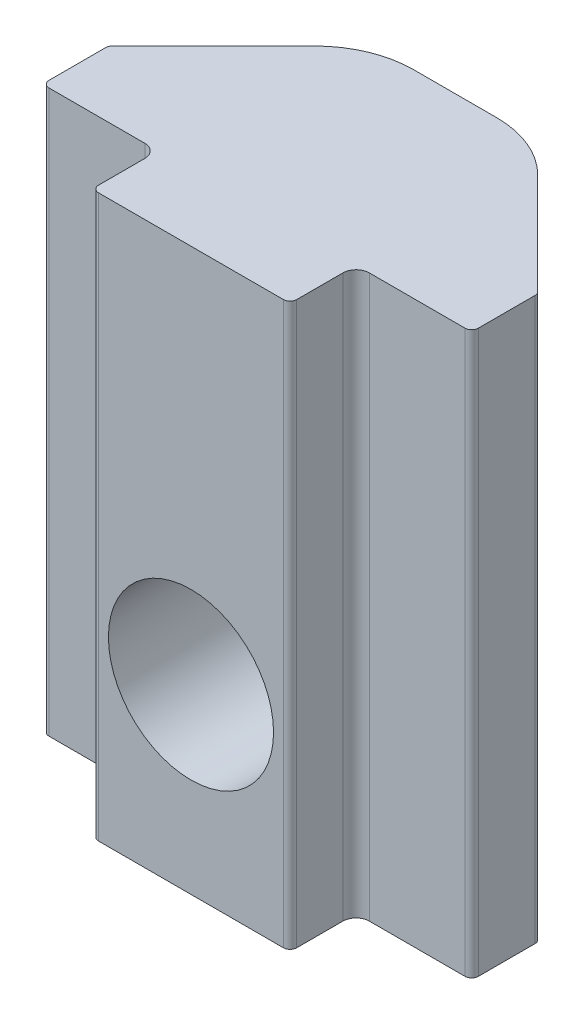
ISO-10303-21;
HEADER;
FILE_DESCRIPTION(('STEP AP214'),'2;1');
FILE_NAME('part.step','',(''),(''),'','','');
FILE_SCHEMA(('AUTOMOTIVE_DESIGN { 1 0 10303 214 1 1 1 1 }'));
ENDSEC;
DATA;
#1=APPLICATION_CONTEXT('core data for automotive mechanical design processes');
#2=APPLICATION_PROTOCOL_DEFINITION('international standard','automotive_design',2000,#1);
#3=PRODUCT_CONTEXT('',#1,'mechanical');
#4=PRODUCT('Part','Part','',(#3));
#5=PRODUCT_RELATED_PRODUCT_CATEGORY('part','',(#4));
#6=PRODUCT_DEFINITION_FORMATION('','',#4);
#7=PRODUCT_DEFINITION_CONTEXT('part definition',#1,'design');
#8=PRODUCT_DEFINITION('design','',#6,#7);
#9=PRODUCT_DEFINITION_SHAPE('','',#8);
#10=(LENGTH_UNIT() NAMED_UNIT(*) SI_UNIT(.MILLI.,.METRE.));
#11=(NAMED_UNIT(*) PLANE_ANGLE_UNIT() SI_UNIT($,.RADIAN.));
#12=(NAMED_UNIT(*) SI_UNIT($,.STERADIAN.) SOLID_ANGLE_UNIT());
#13=UNCERTAINTY_MEASURE_WITH_UNIT(LENGTH_MEASURE(1.E-05),#10,'distance_accuracy_value','');
#14=(GEOMETRIC_REPRESENTATION_CONTEXT(3) GLOBAL_UNCERTAINTY_ASSIGNED_CONTEXT((#13)) GLOBAL_UNIT_ASSIGNED_CONTEXT((#10,
#11,#12)) REPRESENTATION_CONTEXT('',''));
#15=CARTESIAN_POINT('',(0.,0.,0.));
#16=DIRECTION('',(0.,0.,1.));
#17=DIRECTION('',(1.,0.,0.));
#18=AXIS2_PLACEMENT_3D('',#15,#16,#17);
#19=CARTESIAN_POINT('',(-5.00000019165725E-09,1000.,-6.00000001));
#20=DIRECTION('',(0.,0.,-1.));
#21=DIRECTION('',(0.,-1.,0.));
#22=AXIS2_PLACEMENT_3D('',#19,#20,#21);
#23=PLANE('',#22);
#24=CARTESIAN_POINT('',(0.,-994.5,-6.00000001));
#25=DIRECTION('',(0.,0.,1.));
#26=DIRECTION('',(1.,0.,0.));
#27=AXIS2_PLACEMENT_3D('',#24,#25,#26);
#28=CIRCLE('',#27,2.5);
#29=CARTESIAN_POINT('',(1.25735931,-992.339202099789,-6.00000001));
#30=VERTEX_POINT('',#29);
#31=CARTESIAN_POINT('',(-1.25735932,-992.339202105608,-6.00000001));
#32=VERTEX_POINT('',#31);
#33=EDGE_CURVE('E59',#30,#32,#28,.T.);
#34=ORIENTED_EDGE('',*,*,#33,.T.);
#35=DIRECTION('',(0.,-1.,0.));
#36=VECTOR('',#35,1.);
#37=CARTESIAN_POINT('',(-1.25735932,1000.,-6.00000001));
#38=LINE('',#37,#36);
#39=CARTESIAN_POINT('',(-1.25735932,-983.,-6.00000001));
#40=VERTEX_POINT('',#39);
#41=EDGE_CURVE('E205',#40,#32,#38,.T.);
#42=ORIENTED_EDGE('',*,*,#41,.F.);
#43=DIRECTION('',(1.,0.,0.));
#44=VECTOR('',#43,1.);
#45=CARTESIAN_POINT('',(-6.49999999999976,-983.,-6.00000001));
#46=LINE('',#45,#44);
#47=CARTESIAN_POINT('',(1.25735931,-983.,-6.00000001));
#48=VERTEX_POINT('',#47);
#49=EDGE_CURVE('E385',#40,#48,#46,.T.);
#50=ORIENTED_EDGE('',*,*,#49,.T.);
#51=DIRECTION('',(0.,-1.,0.));
#52=VECTOR('',#51,1.);
#53=CARTESIAN_POINT('',(1.25735931,1000.,-6.00000001));
#54=LINE('',#53,#52);
#55=EDGE_CURVE('E207',#48,#30,#54,.T.);
#56=ORIENTED_EDGE('',*,*,#55,.T.);
#57=EDGE_LOOP('',(#34,#42,#50,#56));
#58=FACE_BOUND('',#57,.T.);
#59=ADVANCED_FACE('F44',(#58),#23,.T.);
#60=CARTESIAN_POINT('',(-5.10307701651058E-09,-1000.,-1.69499752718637));
#61=DIRECTION('',(0.,-1.,0.));
#62=DIRECTION('',(0.,0.,-1.));
#63=AXIS2_PLACEMENT_3D('',#60,#61,#62);
#64=PLANE('',#63);
#65=DIRECTION('',(0.,0.,1.));
#66=VECTOR('',#65,1.);
#67=CARTESIAN_POINT('',(-3.00000001,-1000.,0.4));
#68=LINE('',#67,#66);
#69=CARTESIAN_POINT('',(-3.,-1000.,0.4));
#70=VERTEX_POINT('',#69);
#71=CARTESIAN_POINT('',(-3.00000001,-1000.,1.8));
#72=VERTEX_POINT('',#71);
#73=EDGE_CURVE('E241',#70,#72,#68,.T.);
#74=ORIENTED_EDGE('',*,*,#73,.F.);
#75=CARTESIAN_POINT('',(-3.4,-1000.,0.4));
#76=DIRECTION('',(0.,-1.,0.));
#77=DIRECTION('',(0.,0.,-1.));
#78=AXIS2_PLACEMENT_3D('',#75,#76,#77);
#79=CIRCLE('',#78,0.4);
#80=CARTESIAN_POINT('',(-3.4,-1000.,0.));
#81=VERTEX_POINT('',#80);
#82=EDGE_CURVE('E52',#81,#70,#79,.T.);
#83=ORIENTED_EDGE('',*,*,#82,.F.);
#84=DIRECTION('',(1.,0.,0.));
#85=VECTOR('',#84,1.);
#86=CARTESIAN_POINT('',(-6.3,-1000.,0.));
#87=LINE('',#86,#85);
#88=CARTESIAN_POINT('',(-6.3,-1000.,0.));
#89=VERTEX_POINT('',#88);
#90=EDGE_CURVE('E255',#89,#81,#87,.T.);
#91=ORIENTED_EDGE('',*,*,#90,.F.);
#92=CARTESIAN_POINT('',(-6.3,-1000.,-0.2));
#93=DIRECTION('',(0.,1.,0.));
#94=DIRECTION('',(0.,0.,1.));
#95=AXIS2_PLACEMENT_3D('',#92,#93,#94);
#96=CIRCLE('',#95,0.2);
#97=CARTESIAN_POINT('',(-6.5,-1000.,-0.2));
#98=VERTEX_POINT('',#97);
#99=EDGE_CURVE('E274',#98,#89,#96,.T.);
#100=ORIENTED_EDGE('',*,*,#99,.F.);
#101=DIRECTION('',(0.,0.,1.));
#102=VECTOR('',#101,1.);
#103=CARTESIAN_POINT('',(-6.5,-1000.,-1.91715729));
#104=LINE('',#103,#102);
#105=CARTESIAN_POINT('',(-6.5,-1000.,-1.91715729));
#106=VERTEX_POINT('',#105);
#107=EDGE_CURVE('E277',#106,#98,#104,.T.);
#108=ORIENTED_EDGE('',*,*,#107,.F.);
#109=CARTESIAN_POINT('',(-6.3,-1000.,-1.91715728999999));
#110=DIRECTION('',(0.,1.,0.));
#111=DIRECTION('',(-1.,0.,0.));
#112=AXIS2_PLACEMENT_3D('',#109,#110,#111);
#113=CIRCLE('',#112,0.200000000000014);
#114=CARTESIAN_POINT('',(-6.44142136,-1000.,-2.05857865));
#115=VERTEX_POINT('',#114);
#116=EDGE_CURVE('E256',#115,#106,#113,.T.);
#117=ORIENTED_EDGE('',*,*,#116,.F.);
#118=DIRECTION('',(-0.707106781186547,0.,0.707106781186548));
#119=VECTOR('',#118,1.);
#120=CARTESIAN_POINT('',(-3.37867966,-1000.,-5.12132035));
#121=LINE('',#120,#119);
#122=CARTESIAN_POINT('',(-3.37867966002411,-1000.,-5.12132035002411));
#123=VERTEX_POINT('',#122);
#124=EDGE_CURVE('E290',#123,#115,#121,.T.);
#125=ORIENTED_EDGE('',*,*,#124,.F.);
#126=CARTESIAN_POINT('',(-1.25735932,-1000.,-3.00000000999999));
#127=DIRECTION('',(0.,1.,0.));
#128=DIRECTION('',(-0.707106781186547,0.,-0.707106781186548));
#129=AXIS2_PLACEMENT_3D('',#126,#127,#128);
#130=CIRCLE('',#129,2.99999999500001);
#131=CARTESIAN_POINT('',(-1.25735932,-1000.,-6.00000001));
#132=VERTEX_POINT('',#131);
#133=EDGE_CURVE('E213',#132,#123,#130,.T.);
#134=ORIENTED_EDGE('',*,*,#133,.F.);
#135=DIRECTION('',(-1.,0.,0.));
#136=VECTOR('',#135,1.);
#137=CARTESIAN_POINT('',(1.25735931,-1000.,-6.00000001));
#138=LINE('',#137,#136);
#139=CARTESIAN_POINT('',(1.25735931,-1000.,-6.00000001));
#140=VERTEX_POINT('',#139);
#141=EDGE_CURVE('E219',#140,#132,#138,.T.);
#142=ORIENTED_EDGE('',*,*,#141,.F.);
#143=CARTESIAN_POINT('',(1.25735931,-1000.,-3.00000001));
#144=DIRECTION('',(0.,1.,0.));
#145=DIRECTION('',(0.,0.,-1.));
#146=AXIS2_PLACEMENT_3D('',#143,#144,#145);
#147=CIRCLE('',#146,3.);
#148=CARTESIAN_POINT('',(3.37867965,-1000.,-5.12132035));
#149=VERTEX_POINT('',#148);
#150=EDGE_CURVE('E261',#149,#140,#147,.T.);
#151=ORIENTED_EDGE('',*,*,#150,.F.);
#152=DIRECTION('',(-0.707106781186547,0.,-0.707106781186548));
#153=VECTOR('',#152,1.);
#154=CARTESIAN_POINT('',(6.44142135,-1000.,-2.05857865));
#155=LINE('',#154,#153);
#156=CARTESIAN_POINT('',(6.44142134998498,-1000.,-2.05857864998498));
#157=VERTEX_POINT('',#156);
#158=EDGE_CURVE('E233',#157,#149,#155,.T.);
#159=ORIENTED_EDGE('',*,*,#158,.F.);
#160=CARTESIAN_POINT('',(6.29999999,-1000.,-1.91715729));
#161=DIRECTION('',(0.,1.,0.));
#162=DIRECTION('',(0.707106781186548,0.,-0.707106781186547));
#163=AXIS2_PLACEMENT_3D('',#160,#161,#162);
#164=CIRCLE('',#163,0.2000000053);
#165=CARTESIAN_POINT('',(6.49999999,-1000.,-1.91715729));
#166=VERTEX_POINT('',#165);
#167=EDGE_CURVE('E234',#166,#157,#164,.T.);
#168=ORIENTED_EDGE('',*,*,#167,.F.);
#169=DIRECTION('',(0.,0.,-1.));
#170=VECTOR('',#169,1.);
#171=CARTESIAN_POINT('',(6.49999999,-1000.,-0.2));
#172=LINE('',#171,#170);
#173=CARTESIAN_POINT('',(6.49999999,-1000.,-0.2));
#174=VERTEX_POINT('',#173);
#175=EDGE_CURVE('E287',#174,#166,#172,.T.);
#176=ORIENTED_EDGE('',*,*,#175,.F.);
#177=CARTESIAN_POINT('',(6.29999999,-1000.,-0.2));
#178=DIRECTION('',(0.,1.,0.));
#179=DIRECTION('',(1.,0.,0.));
#180=AXIS2_PLACEMENT_3D('',#177,#178,#179);
#181=CIRCLE('',#180,0.2);
#182=CARTESIAN_POINT('',(6.29999999,-1000.,0.));
#183=VERTEX_POINT('',#182);
#184=EDGE_CURVE('E235',#183,#174,#181,.T.);
#185=ORIENTED_EDGE('',*,*,#184,.F.);
#186=DIRECTION('',(1.,0.,0.));
#187=VECTOR('',#186,1.);
#188=CARTESIAN_POINT('',(3.39999999,-1000.,0.));
#189=LINE('',#188,#187);
#190=CARTESIAN_POINT('',(3.39999999,-1000.,0.));
#191=VERTEX_POINT('',#190);
#192=EDGE_CURVE('E244',#191,#183,#189,.T.);
#193=ORIENTED_EDGE('',*,*,#192,.F.);
#194=CARTESIAN_POINT('',(3.39999999,-1000.,0.4));
#195=DIRECTION('',(0.,-1.,0.));
#196=DIRECTION('',(-1.,0.,0.));
#197=AXIS2_PLACEMENT_3D('',#194,#195,#196);
#198=CIRCLE('',#197,0.4);
#199=CARTESIAN_POINT('',(2.99999999,-1000.,0.4));
#200=VERTEX_POINT('',#199);
#201=EDGE_CURVE('E245',#200,#191,#198,.T.);
#202=ORIENTED_EDGE('',*,*,#201,.F.);
#203=DIRECTION('',(0.,0.,-1.));
#204=VECTOR('',#203,1.);
#205=CARTESIAN_POINT('',(2.99999999,-1000.,1.8));
#206=LINE('',#205,#204);
#207=CARTESIAN_POINT('',(2.99999999,-1000.,1.8));
#208=VERTEX_POINT('',#207);
#209=EDGE_CURVE('E222',#208,#200,#206,.T.);
#210=ORIENTED_EDGE('',*,*,#209,.F.);
#211=CARTESIAN_POINT('',(2.79999999,-1000.,1.8));
#212=DIRECTION('',(0.,1.,0.));
#213=DIRECTION('',(1.,0.,0.));
#214=AXIS2_PLACEMENT_3D('',#211,#212,#213);
#215=CIRCLE('',#214,0.2);
#216=CARTESIAN_POINT('',(2.79999999,-1000.,2.));
#217=VERTEX_POINT('',#216);
#218=EDGE_CURVE('E250',#217,#208,#215,.T.);
#219=ORIENTED_EDGE('',*,*,#218,.F.);
#220=DIRECTION('',(1.,0.,0.));
#221=VECTOR('',#220,1.);
#222=CARTESIAN_POINT('',(-2.80000001,-1000.,2.));
#223=LINE('',#222,#221);
#224=CARTESIAN_POINT('',(-2.80000001,-1000.,2.));
#225=VERTEX_POINT('',#224);
#226=EDGE_CURVE('E230',#225,#217,#223,.T.);
#227=ORIENTED_EDGE('',*,*,#226,.F.);
#228=CARTESIAN_POINT('',(-2.80000001,-1000.,1.8));
#229=DIRECTION('',(0.,1.,0.));
#230=DIRECTION('',(0.,0.,1.));
#231=AXIS2_PLACEMENT_3D('',#228,#229,#230);
#232=CIRCLE('',#231,0.2);
#233=EDGE_CURVE('E226',#72,#225,#232,.T.);
#234=ORIENTED_EDGE('',*,*,#233,.F.);
#235=EDGE_LOOP('',(#74,#83,#91,#100,#108,#117,#125,#134,#142,#151,#159,#168,#176,#185,#193,#202,
#210,#219,#227,#234));
#236=FACE_BOUND('',#235,.T.);
#237=ADVANCED_FACE('F310',(#236),#64,.T.);
#238=CARTESIAN_POINT('',(-3.4,1000.,0.4));
#239=DIRECTION('',(0.,-1.,0.));
#240=DIRECTION('',(0.,0.,-1.));
#241=AXIS2_PLACEMENT_3D('',#238,#239,#240);
#242=CYLINDRICAL_SURFACE('',#241,0.4);
#243=DIRECTION('',(0.,-1.,0.));
#244=VECTOR('',#243,1.);
#245=CARTESIAN_POINT('',(-3.,1000.,0.4));
#246=LINE('',#245,#244);
#247=CARTESIAN_POINT('',(-3.,-983.,0.4));
#248=VERTEX_POINT('',#247);
#249=EDGE_CURVE('E224',#248,#70,#246,.T.);
#250=ORIENTED_EDGE('',*,*,#249,.F.);
#251=CARTESIAN_POINT('',(-3.4,-983.,0.4));
#252=DIRECTION('',(0.,-1.,0.));
#253=DIRECTION('',(0.,0.,-1.));
#254=AXIS2_PLACEMENT_3D('',#251,#252,#253);
#255=CIRCLE('',#254,0.4);
#256=CARTESIAN_POINT('',(-3.4,-983.,0.));
#257=VERTEX_POINT('',#256);
#258=EDGE_CURVE('E66',#248,#257,#255,.F.);
#259=ORIENTED_EDGE('',*,*,#258,.T.);
#260=DIRECTION('',(0.,-1.,0.));
#261=VECTOR('',#260,1.);
#262=CARTESIAN_POINT('',(-3.4,1000.,0.));
#263=LINE('',#262,#261);
#264=EDGE_CURVE('E253',#257,#81,#263,.T.);
#265=ORIENTED_EDGE('',*,*,#264,.T.);
#266=ORIENTED_EDGE('',*,*,#82,.T.);
#267=EDGE_LOOP('',(#250,#259,#265,#266));
#268=FACE_BOUND('',#267,.T.);
#269=ADVANCED_FACE('F340',(#268),#242,.F.);
#270=CARTESIAN_POINT('',(-4.85,1000.,0.));
#271=DIRECTION('',(0.,0.,1.));
#272=DIRECTION('',(1.,0.,0.));
#273=AXIS2_PLACEMENT_3D('',#270,#271,#272);
#274=PLANE('',#273);
#275=DIRECTION('',(1.,0.,0.));
#276=VECTOR('',#275,1.);
#277=CARTESIAN_POINT('',(-4.85,-983.,0.));
#278=LINE('',#277,#276);
#279=CARTESIAN_POINT('',(-6.3,-983.,0.));
#280=VERTEX_POINT('',#279);
#281=EDGE_CURVE('E347',#280,#257,#278,.T.);
#282=ORIENTED_EDGE('',*,*,#281,.F.);
#283=DIRECTION('',(0.,-1.,0.));
#284=VECTOR('',#283,1.);
#285=CARTESIAN_POINT('',(-6.3,1000.,0.));
#286=LINE('',#285,#284);
#287=EDGE_CURVE('E272',#280,#89,#286,.T.);
#288=ORIENTED_EDGE('',*,*,#287,.T.);
#289=ORIENTED_EDGE('',*,*,#90,.T.);
#290=ORIENTED_EDGE('',*,*,#264,.F.);
#291=EDGE_LOOP('',(#282,#288,#289,#290));
#292=FACE_BOUND('',#291,.T.);
#293=ADVANCED_FACE('F345',(#292),#274,.T.);
#294=CARTESIAN_POINT('',(-6.3,1000.,-0.2));
#295=DIRECTION('',(0.,-1.,0.));
#296=DIRECTION('',(0.,0.,1.));
#297=AXIS2_PLACEMENT_3D('',#294,#295,#296);
#298=CYLINDRICAL_SURFACE('',#297,0.2);
#299=CARTESIAN_POINT('',(-6.3,-983.,-0.2));
#300=DIRECTION('',(0.,-1.,0.));
#301=DIRECTION('',(0.,0.,-1.));
#302=AXIS2_PLACEMENT_3D('',#299,#300,#301);
#303=CIRCLE('',#302,0.2);
#304=CARTESIAN_POINT('',(-6.49999999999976,-983.,-0.2));
#305=VERTEX_POINT('',#304);
#306=EDGE_CURVE('E351',#305,#280,#303,.F.);
#307=ORIENTED_EDGE('',*,*,#306,.F.);
#308=DIRECTION('',(0.,-1.,0.));
#309=VECTOR('',#308,1.);
#310=CARTESIAN_POINT('',(-6.5,1000.,-0.2));
#311=LINE('',#310,#309);
#312=EDGE_CURVE('E275',#305,#98,#311,.T.);
#313=ORIENTED_EDGE('',*,*,#312,.T.);
#314=ORIENTED_EDGE('',*,*,#99,.T.);
#315=ORIENTED_EDGE('',*,*,#287,.F.);
#316=EDGE_LOOP('',(#307,#313,#314,#315));
#317=FACE_BOUND('',#316,.T.);
#318=ADVANCED_FACE('F350',(#317),#298,.T.);
#319=CARTESIAN_POINT('',(-6.5,1000.,-1.058578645));
#320=DIRECTION('',(-1.,0.,0.));
#321=DIRECTION('',(0.,0.,1.));
#322=AXIS2_PLACEMENT_3D('',#319,#320,#321);
#323=PLANE('',#322);
#324=DIRECTION('',(0.,0.,1.));
#325=VECTOR('',#324,1.);
#326=CARTESIAN_POINT('',(-6.49999999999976,-983.,-6.00000001));
#327=LINE('',#326,#325);
#328=CARTESIAN_POINT('',(-6.49999999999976,-983.,-1.91715728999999));
#329=VERTEX_POINT('',#328);
#330=EDGE_CURVE('E383',#329,#305,#327,.T.);
#331=ORIENTED_EDGE('',*,*,#330,.F.);
#332=DIRECTION('',(0.,-1.,0.));
#333=VECTOR('',#332,1.);
#334=CARTESIAN_POINT('',(-6.5,1000.,-1.91715729));
#335=LINE('',#334,#333);
#336=EDGE_CURVE('E259',#329,#106,#335,.T.);
#337=ORIENTED_EDGE('',*,*,#336,.T.);
#338=ORIENTED_EDGE('',*,*,#107,.T.);
#339=ORIENTED_EDGE('',*,*,#312,.F.);
#340=EDGE_LOOP('',(#331,#337,#338,#339));
#341=FACE_BOUND('',#340,.T.);
#342=ADVANCED_FACE('F355',(#341),#323,.T.);
#343=CARTESIAN_POINT('',(-6.3,1000.,-1.91715728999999));
#344=DIRECTION('',(0.,-1.,0.));
#345=DIRECTION('',(-1.,0.,0.));
#346=AXIS2_PLACEMENT_3D('',#343,#344,#345);
#347=CYLINDRICAL_SURFACE('',#346,0.200000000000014);
#348=CARTESIAN_POINT('',(-6.3,-983.,-1.91715728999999));
#349=DIRECTION('',(0.,-1.,0.));
#350=DIRECTION('',(0.,0.,-1.));
#351=AXIS2_PLACEMENT_3D('',#348,#349,#350);
#352=CIRCLE('',#351,0.200000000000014);
#353=CARTESIAN_POINT('',(-6.44142136,-983.,-2.05857865));
#354=VERTEX_POINT('',#353);
#355=EDGE_CURVE('E303',#354,#329,#352,.F.);
#356=ORIENTED_EDGE('',*,*,#355,.F.);
#357=DIRECTION('',(0.,-1.,0.));
#358=VECTOR('',#357,1.);
#359=CARTESIAN_POINT('',(-6.44142136,1000.,-2.05857865));
#360=LINE('',#359,#358);
#361=EDGE_CURVE('E260',#354,#115,#360,.T.);
#362=ORIENTED_EDGE('',*,*,#361,.T.);
#363=ORIENTED_EDGE('',*,*,#116,.T.);
#364=ORIENTED_EDGE('',*,*,#336,.F.);
#365=EDGE_LOOP('',(#356,#362,#363,#364));
#366=FACE_BOUND('',#365,.T.);
#367=ADVANCED_FACE('F301',(#366),#347,.T.);
#368=CARTESIAN_POINT('',(-4.91005051,1000.,-3.5899495));
#369=DIRECTION('',(-0.707106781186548,0.,-0.707106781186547));
#370=DIRECTION('',(-0.707106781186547,0.,0.707106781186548));
#371=AXIS2_PLACEMENT_3D('',#368,#369,#370);
#372=PLANE('',#371);
#373=DIRECTION('',(-0.707106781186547,0.,0.707106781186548));
#374=VECTOR('',#373,1.);
#375=CARTESIAN_POINT('',(-4.91005051,-983.,-3.5899495));
#376=LINE('',#375,#374);
#377=CARTESIAN_POINT('',(-3.37867966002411,-983.,-5.12132035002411));
#378=VERTEX_POINT('',#377);
#379=EDGE_CURVE('E315',#378,#354,#376,.T.);
#380=ORIENTED_EDGE('',*,*,#379,.F.);
#381=DIRECTION('',(0.,-1.,0.));
#382=VECTOR('',#381,1.);
#383=CARTESIAN_POINT('',(-3.37867966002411,1000.,-5.12132035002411));
#384=LINE('',#383,#382);
#385=EDGE_CURVE('E217',#378,#123,#384,.T.);
#386=ORIENTED_EDGE('',*,*,#385,.T.);
#387=ORIENTED_EDGE('',*,*,#124,.T.);
#388=ORIENTED_EDGE('',*,*,#361,.F.);
#389=EDGE_LOOP('',(#380,#386,#387,#388));
#390=FACE_BOUND('',#389,.T.);
#391=ADVANCED_FACE('F314',(#390),#372,.T.);
#392=CARTESIAN_POINT('',(-1.25735932,1000.,-3.00000000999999));
#393=DIRECTION('',(0.,-1.,0.));
#394=DIRECTION('',(-0.707106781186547,0.,-0.707106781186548));
#395=AXIS2_PLACEMENT_3D('',#392,#393,#394);
#396=CYLINDRICAL_SURFACE('',#395,2.99999999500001);
#397=CARTESIAN_POINT('',(-1.25735932,-996.660797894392,-6.000000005));
#398=CARTESIAN_POINT('',(-1.31608258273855,-996.626639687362,-6.00000708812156));
#399=CARTESIAN_POINT('',(-1.37337508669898,-996.590085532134,-5.99827624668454));
#400=CARTESIAN_POINT('',(-1.4846434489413,-996.512563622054,-5.99189447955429));
#401=CARTESIAN_POINT('',(-1.53862243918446,-996.47160013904,-5.98724635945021));
#402=CARTESIAN_POINT('',(-1.64271093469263,-996.385745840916,-5.97560739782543));
#403=CARTESIAN_POINT('',(-1.69283527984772,-996.340871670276,-5.96862615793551));
#404=CARTESIAN_POINT('',(-1.78916864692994,-996.247393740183,-5.95289047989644));
#405=CARTESIAN_POINT('',(-1.83537674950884,-996.198789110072,-5.94413562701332));
#406=CARTESIAN_POINT('',(-1.96745905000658,-996.048183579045,-5.9161334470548));
#407=CARTESIAN_POINT('',(-2.04721332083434,-995.941041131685,-5.89509251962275));
#408=CARTESIAN_POINT('',(-2.18873334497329,-995.715414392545,-5.8527222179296));
#409=CARTESIAN_POINT('',(-2.25047488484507,-995.596915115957,-5.83139249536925));
#410=CARTESIAN_POINT('',(-2.35791068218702,-995.342892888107,-5.79146926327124));
#411=CARTESIAN_POINT('',(-2.40228997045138,-995.206763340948,-5.77314625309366));
#412=CARTESIAN_POINT('',(-2.46720620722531,-994.928140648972,-5.74546070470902));
#413=CARTESIAN_POINT('',(-2.48777143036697,-994.785655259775,-5.73608754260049));
#414=CARTESIAN_POINT('',(-2.50358919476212,-994.508292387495,-5.72891437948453));
#415=CARTESIAN_POINT('',(-2.50039799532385,-994.373521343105,-5.73040272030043));
#416=CARTESIAN_POINT('',(-2.47250983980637,-994.106682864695,-5.74292405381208));
#417=CARTESIAN_POINT('',(-2.44780914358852,-993.974615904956,-5.75395870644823));
#418=CARTESIAN_POINT('',(-2.37915972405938,-993.7213935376,-5.78260182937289));
#419=CARTESIAN_POINT('',(-2.3359085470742,-993.600018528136,-5.79996893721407));
#420=CARTESIAN_POINT('',(-2.23153165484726,-993.365653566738,-5.83796812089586));
#421=CARTESIAN_POINT('',(-2.17038758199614,-993.252672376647,-5.85860353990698));
#422=CARTESIAN_POINT('',(-2.02520371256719,-993.027557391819,-5.90114563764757));
#423=CARTESIAN_POINT('',(-1.93959382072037,-992.916423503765,-5.92299860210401));
#424=CARTESIAN_POINT('',(-1.75048170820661,-992.709655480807,-5.96075331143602));
#425=CARTESIAN_POINT('',(-1.64702510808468,-992.613983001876,-5.97666991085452));
#426=CARTESIAN_POINT('',(-1.49183677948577,-992.493117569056,-5.99115362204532));
#427=CARTESIAN_POINT('',(-1.44643845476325,-992.460154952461,-5.9943974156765));
#428=CARTESIAN_POINT('',(-1.3534747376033,-992.397323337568,-5.99882076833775));
#429=CARTESIAN_POINT('',(-1.30590997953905,-992.367453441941,-6.00000092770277));
#430=CARTESIAN_POINT('',(-1.25735931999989,-992.339202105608,-6.000000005));
#431=B_SPLINE_CURVE_WITH_KNOTS('',3,(#397,#398,#399,#400,#401,#402,#403,#404,#405,#406,#407,
#408,#409,#410,#411,#412,#413,#414,#415,#416,#417,#418,#419,#420,#421,#422,#423,#424,#425,#426,
#427,#428,#429,#430),.UNSPECIFIED.,.F.,.F.,(4,2,2,2,2,2,2,2,2,2,2,2,2,2,2,2,4),(0.,
0.203679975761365,0.407164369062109,0.609821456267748,0.81252598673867,1.21630157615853,
1.62061746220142,2.0513990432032,2.48166862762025,2.88401205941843,3.28642546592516,
3.67487708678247,4.06372865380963,4.48773243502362,4.91066799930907,5.07912013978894,
5.2475232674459),.UNSPECIFIED.);
#432=CARTESIAN_POINT('',(-1.25735932,-996.660797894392,-6.00000001));
#433=VERTEX_POINT('',#432);
#434=EDGE_CURVE('E190',#433,#32,#431,.T.);
#435=ORIENTED_EDGE('',*,*,#434,.F.);
#436=EDGE_CURVE('E214',#433,#132,#38,.T.);
#437=ORIENTED_EDGE('',*,*,#436,.T.);
#438=ORIENTED_EDGE('',*,*,#133,.T.);
#439=ORIENTED_EDGE('',*,*,#385,.F.);
#440=CARTESIAN_POINT('',(-1.25735932,-983.,-3.00000000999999));
#441=DIRECTION('',(0.,-1.,0.));
#442=DIRECTION('',(0.,0.,-1.));
#443=AXIS2_PLACEMENT_3D('',#440,#441,#442);
#444=CIRCLE('',#443,2.99999999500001);
#445=EDGE_CURVE('E212',#40,#378,#444,.F.);
#446=ORIENTED_EDGE('',*,*,#445,.F.);
#447=ORIENTED_EDGE('',*,*,#41,.T.);
#448=EDGE_LOOP('',(#435,#437,#438,#439,#446,#447));
#449=FACE_BOUND('',#448,.T.);
#450=ADVANCED_FACE('F210',(#449),#396,.T.);
#451=CARTESIAN_POINT('',(1.25735931,-996.660797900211,-6.00000001));
#452=VERTEX_POINT('',#451);
#453=EDGE_CURVE('E194',#433,#452,#28,.T.);
#454=ORIENTED_EDGE('',*,*,#453,.T.);
#455=EDGE_CURVE('E252',#452,#140,#54,.T.);
#456=ORIENTED_EDGE('',*,*,#455,.T.);
#457=ORIENTED_EDGE('',*,*,#141,.T.);
#458=ORIENTED_EDGE('',*,*,#436,.F.);
#459=EDGE_LOOP('',(#454,#456,#457,#458));
#460=FACE_BOUND('',#459,.T.);
#461=ADVANCED_FACE('F430',(#460),#23,.T.);
#462=CARTESIAN_POINT('',(1.25735931,1000.,-3.00000001));
#463=DIRECTION('',(0.,-1.,0.));
#464=DIRECTION('',(0.,0.,-1.));
#465=AXIS2_PLACEMENT_3D('',#462,#463,#464);
#466=CYLINDRICAL_SURFACE('',#465,3.);
#467=CARTESIAN_POINT('',(1.25735931,-992.339202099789,-6.00000001));
#468=CARTESIAN_POINT('',(1.31608257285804,-992.373360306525,-6.0000070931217));
#469=CARTESIAN_POINT('',(1.37337507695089,-992.409914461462,-5.9982762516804));
#470=CARTESIAN_POINT('',(1.48464343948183,-992.48743637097,-5.99189448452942));
#471=CARTESIAN_POINT('',(1.53862242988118,-992.528399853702,-5.98724636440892));
#472=CARTESIAN_POINT('',(1.64271092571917,-992.614254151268,-5.97560740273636));
#473=CARTESIAN_POINT('',(1.69283527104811,-992.659128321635,-5.96862616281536));
#474=CARTESIAN_POINT('',(1.78916863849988,-992.752606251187,-5.9528904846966));
#475=CARTESIAN_POINT('',(1.83537674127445,-992.801210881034,-5.94413563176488));
#476=CARTESIAN_POINT('',(1.96745904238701,-992.951816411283,-5.91613345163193));
#477=CARTESIAN_POINT('',(2.04721331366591,-993.058958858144,-5.89509252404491));
#478=CARTESIAN_POINT('',(2.18873333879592,-993.284585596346,-5.85272222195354));
#479=CARTESIAN_POINT('',(2.25047487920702,-993.403084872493,-5.8313924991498));
#480=CARTESIAN_POINT('',(2.35791067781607,-993.657107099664,-5.79146926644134));
#481=CARTESIAN_POINT('',(2.40228996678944,-993.793236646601,-5.77314625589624));
#482=CARTESIAN_POINT('',(2.46720620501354,-994.071859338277,-5.74546070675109));
#483=CARTESIAN_POINT('',(2.48777142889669,-994.214344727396,-5.73608754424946));
#484=CARTESIAN_POINT('',(2.5035891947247,-994.491707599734,-5.72891438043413));
#485=CARTESIAN_POINT('',(2.50039799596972,-994.626478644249,-5.73040272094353));
#486=CARTESIAN_POINT('',(2.47250984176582,-994.893317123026,-5.74292405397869));
#487=CARTESIAN_POINT('',(2.44780914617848,-995.025384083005,-5.75395870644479));
#488=CARTESIAN_POINT('',(2.37915972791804,-995.278606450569,-5.78260182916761));
#489=CARTESIAN_POINT('',(2.33590855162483,-995.399981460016,-5.79996893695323));
#490=CARTESIAN_POINT('',(2.23153166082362,-995.634346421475,-5.83796812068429));
#491=CARTESIAN_POINT('',(2.17038758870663,-995.747327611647,-5.85860353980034));
#492=CARTESIAN_POINT('',(2.02520372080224,-995.972442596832,-5.90114563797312));
#493=CARTESIAN_POINT('',(1.93959382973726,-996.083576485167,-5.92299860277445));
#494=CARTESIAN_POINT('',(1.75048171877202,-996.290344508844,-5.96075331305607));
#495=CARTESIAN_POINT('',(1.64702511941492,-996.386016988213,-5.97666991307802));
#496=CARTESIAN_POINT('',(1.49183678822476,-996.506882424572,-5.99115362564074));
#497=CARTESIAN_POINT('',(1.44643846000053,-996.539845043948,-5.99439741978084));
#498=CARTESIAN_POINT('',(1.35347473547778,-996.60267666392,-5.99882077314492));
#499=CARTESIAN_POINT('',(1.30590997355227,-996.632546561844,-6.00000093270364));
#500=CARTESIAN_POINT('',(1.25735931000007,-996.660797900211,-6.00000001));
#501=B_SPLINE_CURVE_WITH_KNOTS('',3,(#467,#468,#469,#470,#471,#472,#473,#474,#475,#476,#477,
#478,#479,#480,#481,#482,#483,#484,#485,#486,#487,#488,#489,#490,#491,#492,#493,#494,#495,#496,
#497,#498,#499,#500),.UNSPECIFIED.,.F.,.F.,(4,2,2,2,2,2,2,2,2,2,2,2,2,2,2,2,4),(0.,
0.203679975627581,0.407164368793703,0.609821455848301,0.812525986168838,1.21630157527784,
1.62061746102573,2.0513990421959,2.48166862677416,2.8840120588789,3.28642546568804,
3.6748770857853,4.06372865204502,4.48773243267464,4.91066799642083,5.07912015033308,
5.24752329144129),.UNSPECIFIED.);
#502=EDGE_CURVE('E199',#30,#452,#501,.T.);
#503=ORIENTED_EDGE('',*,*,#502,.F.);
#504=ORIENTED_EDGE('',*,*,#55,.F.);
#505=CARTESIAN_POINT('',(1.25735931,-983.,-3.00000001));
#506=DIRECTION('',(0.,-1.,0.));
#507=DIRECTION('',(0.,0.,-1.));
#508=AXIS2_PLACEMENT_3D('',#505,#506,#507);
#509=CIRCLE('',#508,3.);
#510=CARTESIAN_POINT('',(3.37867965,-983.,-5.12132035));
#511=VERTEX_POINT('',#510);
#512=EDGE_CURVE('E360',#511,#48,#509,.F.);
#513=ORIENTED_EDGE('',*,*,#512,.F.);
#514=DIRECTION('',(0.,-1.,0.));
#515=VECTOR('',#514,1.);
#516=CARTESIAN_POINT('',(3.37867965,1000.,-5.12132035));
#517=LINE('',#516,#515);
#518=EDGE_CURVE('E264',#511,#149,#517,.T.);
#519=ORIENTED_EDGE('',*,*,#518,.T.);
#520=ORIENTED_EDGE('',*,*,#150,.T.);
#521=ORIENTED_EDGE('',*,*,#455,.F.);
#522=EDGE_LOOP('',(#503,#504,#513,#519,#520,#521));
#523=FACE_BOUND('',#522,.T.);
#524=ADVANCED_FACE('F425',(#523),#466,.T.);
#525=CARTESIAN_POINT('',(4.9100505,1000.,-3.5899495));
#526=DIRECTION('',(0.707106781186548,0.,-0.707106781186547));
#527=DIRECTION('',(0.,-1.,0.));
#528=AXIS2_PLACEMENT_3D('',#525,#526,#527);
#529=PLANE('',#528);
#530=DIRECTION('',(-0.707106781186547,0.,-0.707106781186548));
#531=VECTOR('',#530,1.);
#532=CARTESIAN_POINT('',(4.9100505,-983.,-3.5899495));
#533=LINE('',#532,#531);
#534=CARTESIAN_POINT('',(6.44142134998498,-983.,-2.05857864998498));
#535=VERTEX_POINT('',#534);
#536=EDGE_CURVE('E362',#535,#511,#533,.T.);
#537=ORIENTED_EDGE('',*,*,#536,.F.);
#538=DIRECTION('',(0.,-1.,0.));
#539=VECTOR('',#538,1.);
#540=CARTESIAN_POINT('',(6.44142134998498,1000.,-2.05857864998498));
#541=LINE('',#540,#539);
#542=EDGE_CURVE('E231',#535,#157,#541,.T.);
#543=ORIENTED_EDGE('',*,*,#542,.T.);
#544=ORIENTED_EDGE('',*,*,#158,.T.);
#545=ORIENTED_EDGE('',*,*,#518,.F.);
#546=EDGE_LOOP('',(#537,#543,#544,#545));
#547=FACE_BOUND('',#546,.T.);
#548=ADVANCED_FACE('F429',(#547),#529,.T.);
#549=CARTESIAN_POINT('',(6.29999999,1000.,-1.91715729));
#550=DIRECTION('',(0.,-1.,0.));
#551=DIRECTION('',(0.707106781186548,0.,-0.707106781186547));
#552=AXIS2_PLACEMENT_3D('',#549,#550,#551);
#553=CYLINDRICAL_SURFACE('',#552,0.2000000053);
#554=CARTESIAN_POINT('',(6.29999999,-983.,-1.91715729));
#555=DIRECTION('',(0.,-1.,0.));
#556=DIRECTION('',(0.,0.,-1.));
#557=AXIS2_PLACEMENT_3D('',#554,#555,#556);
#558=CIRCLE('',#557,0.2000000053);
#559=CARTESIAN_POINT('',(6.49999999,-983.,-1.91715729));
#560=VERTEX_POINT('',#559);
#561=EDGE_CURVE('E364',#560,#535,#558,.F.);
#562=ORIENTED_EDGE('',*,*,#561,.F.);
#563=DIRECTION('',(0.,-1.,0.));
#564=VECTOR('',#563,1.);
#565=CARTESIAN_POINT('',(6.49999999,1000.,-1.91715729));
#566=LINE('',#565,#564);
#567=EDGE_CURVE('E270',#560,#166,#566,.T.);
#568=ORIENTED_EDGE('',*,*,#567,.T.);
#569=ORIENTED_EDGE('',*,*,#167,.T.);
#570=ORIENTED_EDGE('',*,*,#542,.F.);
#571=EDGE_LOOP('',(#562,#568,#569,#570));
#572=FACE_BOUND('',#571,.T.);
#573=ADVANCED_FACE('F420',(#572),#553,.T.);
#574=CARTESIAN_POINT('',(6.49999999,1000.,-1.058578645));
#575=DIRECTION('',(1.,0.,0.));
#576=DIRECTION('',(0.,1.,0.));
#577=AXIS2_PLACEMENT_3D('',#574,#575,#576);
#578=PLANE('',#577);
#579=DIRECTION('',(0.,0.,1.));
#580=VECTOR('',#579,1.);
#581=CARTESIAN_POINT('',(6.49999999,-983.,-6.00000001));
#582=LINE('',#581,#580);
#583=CARTESIAN_POINT('',(6.49999999,-983.,-0.2));
#584=VERTEX_POINT('',#583);
#585=EDGE_CURVE('E382',#560,#584,#582,.T.);
#586=ORIENTED_EDGE('',*,*,#585,.T.);
#587=DIRECTION('',(0.,-1.,0.));
#588=VECTOR('',#587,1.);
#589=CARTESIAN_POINT('',(6.49999999,1000.,-0.2));
#590=LINE('',#589,#588);
#591=EDGE_CURVE('E238',#584,#174,#590,.T.);
#592=ORIENTED_EDGE('',*,*,#591,.T.);
#593=ORIENTED_EDGE('',*,*,#175,.T.);
#594=ORIENTED_EDGE('',*,*,#567,.F.);
#595=EDGE_LOOP('',(#586,#592,#593,#594));
#596=FACE_BOUND('',#595,.T.);
#597=ADVANCED_FACE('F416',(#596),#578,.T.);
#598=CARTESIAN_POINT('',(6.29999999,1000.,-0.2));
#599=DIRECTION('',(0.,-1.,0.));
#600=DIRECTION('',(1.,0.,0.));
#601=AXIS2_PLACEMENT_3D('',#598,#599,#600);
#602=CYLINDRICAL_SURFACE('',#601,0.2);
#603=CARTESIAN_POINT('',(6.29999999,-983.,-0.2));
#604=DIRECTION('',(0.,-1.,0.));
#605=DIRECTION('',(0.,0.,-1.));
#606=AXIS2_PLACEMENT_3D('',#603,#604,#605);
#607=CIRCLE('',#606,0.2);
#608=CARTESIAN_POINT('',(6.29999999,-983.,0.));
#609=VERTEX_POINT('',#608);
#610=EDGE_CURVE('E366',#609,#584,#607,.F.);
#611=ORIENTED_EDGE('',*,*,#610,.F.);
#612=DIRECTION('',(0.,-1.,0.));
#613=VECTOR('',#612,1.);
#614=CARTESIAN_POINT('',(6.29999999,1000.,0.));
#615=LINE('',#614,#613);
#616=EDGE_CURVE('E239',#609,#183,#615,.T.);
#617=ORIENTED_EDGE('',*,*,#616,.T.);
#618=ORIENTED_EDGE('',*,*,#184,.T.);
#619=ORIENTED_EDGE('',*,*,#591,.F.);
#620=EDGE_LOOP('',(#611,#617,#618,#619));
#621=FACE_BOUND('',#620,.T.);
#622=ADVANCED_FACE('F419',(#621),#602,.T.);
#623=CARTESIAN_POINT('',(4.84999999,1000.,0.));
#624=DIRECTION('',(0.,0.,1.));
#625=DIRECTION('',(1.,0.,0.));
#626=AXIS2_PLACEMENT_3D('',#623,#624,#625);
#627=PLANE('',#626);
#628=DIRECTION('',(1.,0.,0.));
#629=VECTOR('',#628,1.);
#630=CARTESIAN_POINT('',(4.84999999,-983.,0.));
#631=LINE('',#630,#629);
#632=CARTESIAN_POINT('',(3.39999999,-983.,0.));
#633=VERTEX_POINT('',#632);
#634=EDGE_CURVE('E368',#633,#609,#631,.T.);
#635=ORIENTED_EDGE('',*,*,#634,.F.);
#636=DIRECTION('',(0.,-1.,0.));
#637=VECTOR('',#636,1.);
#638=CARTESIAN_POINT('',(3.39999999,1000.,0.));
#639=LINE('',#638,#637);
#640=EDGE_CURVE('E242',#633,#191,#639,.T.);
#641=ORIENTED_EDGE('',*,*,#640,.T.);
#642=ORIENTED_EDGE('',*,*,#192,.T.);
#643=ORIENTED_EDGE('',*,*,#616,.F.);
#644=EDGE_LOOP('',(#635,#641,#642,#643));
#645=FACE_BOUND('',#644,.T.);
#646=ADVANCED_FACE('F438',(#645),#627,.T.);
#647=CARTESIAN_POINT('',(3.39999999,1000.,0.4));
#648=DIRECTION('',(0.,-1.,0.));
#649=DIRECTION('',(-1.,0.,0.));
#650=AXIS2_PLACEMENT_3D('',#647,#648,#649);
#651=CYLINDRICAL_SURFACE('',#650,0.4);
#652=ORIENTED_EDGE('',*,*,#640,.F.);
#653=CARTESIAN_POINT('',(3.39999999,-983.,0.4));
#654=DIRECTION('',(0.,-1.,0.));
#655=DIRECTION('',(0.,0.,-1.));
#656=AXIS2_PLACEMENT_3D('',#653,#654,#655);
#657=CIRCLE('',#656,0.4);
#658=CARTESIAN_POINT('',(2.99999999,-983.,0.4));
#659=VERTEX_POINT('',#658);
#660=EDGE_CURVE('E370',#633,#659,#657,.F.);
#661=ORIENTED_EDGE('',*,*,#660,.T.);
#662=DIRECTION('',(0.,-1.,0.));
#663=VECTOR('',#662,1.);
#664=CARTESIAN_POINT('',(2.99999999,1000.,0.4));
#665=LINE('',#664,#663);
#666=EDGE_CURVE('E267',#659,#200,#665,.T.);
#667=ORIENTED_EDGE('',*,*,#666,.T.);
#668=ORIENTED_EDGE('',*,*,#201,.T.);
#669=EDGE_LOOP('',(#652,#661,#667,#668));
#670=FACE_BOUND('',#669,.T.);
#671=ADVANCED_FACE('F452',(#670),#651,.F.);
#672=CARTESIAN_POINT('',(2.99999999,1000.,1.1));
#673=DIRECTION('',(1.,0.,0.));
#674=DIRECTION('',(0.,1.,0.));
#675=AXIS2_PLACEMENT_3D('',#672,#673,#674);
#676=PLANE('',#675);
#677=DIRECTION('',(0.,0.,-1.));
#678=VECTOR('',#677,1.);
#679=CARTESIAN_POINT('',(2.99999999,-983.,1.1));
#680=LINE('',#679,#678);
#681=CARTESIAN_POINT('',(2.99999999,-983.,1.8));
#682=VERTEX_POINT('',#681);
#683=EDGE_CURVE('E373',#682,#659,#680,.T.);
#684=ORIENTED_EDGE('',*,*,#683,.F.);
#685=DIRECTION('',(0.,-1.,0.));
#686=VECTOR('',#685,1.);
#687=CARTESIAN_POINT('',(2.99999999,1000.,1.8));
#688=LINE('',#687,#686);
#689=EDGE_CURVE('E248',#682,#208,#688,.T.);
#690=ORIENTED_EDGE('',*,*,#689,.T.);
#691=ORIENTED_EDGE('',*,*,#209,.T.);
#692=ORIENTED_EDGE('',*,*,#666,.F.);
#693=EDGE_LOOP('',(#684,#690,#691,#692));
#694=FACE_BOUND('',#693,.T.);
#695=ADVANCED_FACE('F46',(#694),#676,.T.);
#696=CARTESIAN_POINT('',(2.79999999,1000.,1.8));
#697=DIRECTION('',(0.,-1.,0.));
#698=DIRECTION('',(1.,0.,0.));
#699=AXIS2_PLACEMENT_3D('',#696,#697,#698);
#700=CYLINDRICAL_SURFACE('',#699,0.2);
#701=CARTESIAN_POINT('',(2.79999999,-983.,1.8));
#702=DIRECTION('',(0.,-1.,0.));
#703=DIRECTION('',(0.,0.,-1.));
#704=AXIS2_PLACEMENT_3D('',#701,#702,#703);
#705=CIRCLE('',#704,0.2);
#706=CARTESIAN_POINT('',(2.79999999,-983.,2.));
#707=VERTEX_POINT('',#706);
#708=EDGE_CURVE('E375',#707,#682,#705,.F.);
#709=ORIENTED_EDGE('',*,*,#708,.F.);
#710=DIRECTION('',(0.,-1.,0.));
#711=VECTOR('',#710,1.);
#712=CARTESIAN_POINT('',(2.79999999,1000.,2.));
#713=LINE('',#712,#711);
#714=EDGE_CURVE('E285',#707,#217,#713,.T.);
#715=ORIENTED_EDGE('',*,*,#714,.T.);
#716=ORIENTED_EDGE('',*,*,#218,.T.);
#717=ORIENTED_EDGE('',*,*,#689,.F.);
#718=EDGE_LOOP('',(#709,#715,#716,#717));
#719=FACE_BOUND('',#718,.T.);
#720=ADVANCED_FACE('F440',(#719),#700,.T.);
#721=CARTESIAN_POINT('',(-1.00000003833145E-08,1000.,2.));
#722=DIRECTION('',(0.,0.,1.));
#723=DIRECTION('',(1.,0.,0.));
#724=AXIS2_PLACEMENT_3D('',#721,#722,#723);
#725=PLANE('',#724);
#726=CARTESIAN_POINT('',(0.,-994.5,2.));
#727=DIRECTION('',(0.,0.,1.));
#728=DIRECTION('',(1.,0.,0.));
#729=AXIS2_PLACEMENT_3D('',#726,#727,#728);
#730=CIRCLE('',#729,2.5);
#731=CARTESIAN_POINT('',(2.5,-994.5,2.));
#732=VERTEX_POINT('',#731);
#733=EDGE_CURVE('E629',#732,#732,#730,.T.);
#734=ORIENTED_EDGE('',*,*,#733,.F.);
#735=EDGE_LOOP('',(#734));
#736=FACE_BOUND('',#735,.T.);
#737=DIRECTION('',(1.,0.,0.));
#738=VECTOR('',#737,1.);
#739=CARTESIAN_POINT('',(-6.49999999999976,-983.,2.));
#740=LINE('',#739,#738);
#741=CARTESIAN_POINT('',(-2.80000001,-983.,2.));
#742=VERTEX_POINT('',#741);
#743=EDGE_CURVE('E198',#742,#707,#740,.T.);
#744=ORIENTED_EDGE('',*,*,#743,.F.);
#745=DIRECTION('',(0.,-1.,0.));
#746=VECTOR('',#745,1.);
#747=CARTESIAN_POINT('',(-2.80000001,1000.,2.));
#748=LINE('',#747,#746);
#749=EDGE_CURVE('E228',#742,#225,#748,.T.);
#750=ORIENTED_EDGE('',*,*,#749,.T.);
#751=ORIENTED_EDGE('',*,*,#226,.T.);
#752=ORIENTED_EDGE('',*,*,#714,.F.);
#753=EDGE_LOOP('',(#744,#750,#751,#752));
#754=FACE_BOUND('',#753,.T.);
#755=ADVANCED_FACE('F443',(#736,#754),#725,.T.);
#756=CARTESIAN_POINT('',(-2.80000001,1000.,1.8));
#757=DIRECTION('',(0.,-1.,0.));
#758=DIRECTION('',(0.,0.,1.));
#759=AXIS2_PLACEMENT_3D('',#756,#757,#758);
#760=CYLINDRICAL_SURFACE('',#759,0.2);
#761=CARTESIAN_POINT('',(-2.80000001,-983.,1.8));
#762=DIRECTION('',(0.,-1.,0.));
#763=DIRECTION('',(0.,0.,-1.));
#764=AXIS2_PLACEMENT_3D('',#761,#762,#763);
#765=CIRCLE('',#764,0.2);
#766=CARTESIAN_POINT('',(-3.00000001,-983.,1.8));
#767=VERTEX_POINT('',#766);
#768=EDGE_CURVE('E380',#767,#742,#765,.F.);
#769=ORIENTED_EDGE('',*,*,#768,.F.);
#770=DIRECTION('',(0.,-1.,0.));
#771=VECTOR('',#770,1.);
#772=CARTESIAN_POINT('',(-3.00000001,1000.,1.8));
#773=LINE('',#772,#771);
#774=EDGE_CURVE('E227',#767,#72,#773,.T.);
#775=ORIENTED_EDGE('',*,*,#774,.T.);
#776=ORIENTED_EDGE('',*,*,#233,.T.);
#777=ORIENTED_EDGE('',*,*,#749,.F.);
#778=EDGE_LOOP('',(#769,#775,#776,#777));
#779=FACE_BOUND('',#778,.T.);
#780=ADVANCED_FACE('F331',(#779),#760,.T.);
#781=CARTESIAN_POINT('',(-3.00000001,1000.,1.1));
#782=DIRECTION('',(-1.,0.,0.));
#783=DIRECTION('',(0.,0.,1.));
#784=AXIS2_PLACEMENT_3D('',#781,#782,#783);
#785=PLANE('',#784);
#786=DIRECTION('',(0.,0.,1.));
#787=VECTOR('',#786,1.);
#788=CARTESIAN_POINT('',(-3.00000001,-983.,1.1));
#789=LINE('',#788,#787);
#790=EDGE_CURVE('E11',#248,#767,#789,.T.);
#791=ORIENTED_EDGE('',*,*,#790,.F.);
#792=ORIENTED_EDGE('',*,*,#249,.T.);
#793=ORIENTED_EDGE('',*,*,#73,.T.);
#794=ORIENTED_EDGE('',*,*,#774,.F.);
#795=EDGE_LOOP('',(#791,#792,#793,#794));
#796=FACE_BOUND('',#795,.T.);
#797=ADVANCED_FACE('F337',(#796),#785,.T.);
#798=CARTESIAN_POINT('',(-6.49999999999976,-983.,-6.00000001));
#799=DIRECTION('',(0.,-1.,0.));
#800=DIRECTION('',(0.,0.,-1.));
#801=AXIS2_PLACEMENT_3D('',#798,#799,#800);
#802=PLANE('',#801);
#803=ORIENTED_EDGE('',*,*,#355,.T.);
#804=ORIENTED_EDGE('',*,*,#330,.T.);
#805=ORIENTED_EDGE('',*,*,#306,.T.);
#806=ORIENTED_EDGE('',*,*,#281,.T.);
#807=ORIENTED_EDGE('',*,*,#258,.F.);
#808=ORIENTED_EDGE('',*,*,#790,.T.);
#809=ORIENTED_EDGE('',*,*,#768,.T.);
#810=ORIENTED_EDGE('',*,*,#743,.T.);
#811=ORIENTED_EDGE('',*,*,#708,.T.);
#812=ORIENTED_EDGE('',*,*,#683,.T.);
#813=ORIENTED_EDGE('',*,*,#660,.F.);
#814=ORIENTED_EDGE('',*,*,#634,.T.);
#815=ORIENTED_EDGE('',*,*,#610,.T.);
#816=ORIENTED_EDGE('',*,*,#585,.F.);
#817=ORIENTED_EDGE('',*,*,#561,.T.);
#818=ORIENTED_EDGE('',*,*,#536,.T.);
#819=ORIENTED_EDGE('',*,*,#512,.T.);
#820=ORIENTED_EDGE('',*,*,#49,.F.);
#821=ORIENTED_EDGE('',*,*,#445,.T.);
#822=ORIENTED_EDGE('',*,*,#379,.T.);
#823=EDGE_LOOP('',(#803,#804,#805,#806,#807,#808,#809,#810,#811,#812,#813,#814,#815,#816,#817,
#818,#819,#820,#821,#822));
#824=FACE_BOUND('',#823,.T.);
#825=ADVANCED_FACE('F408',(#824),#802,.F.);
#826=CARTESIAN_POINT('',(0.,-994.5,-6.00000001));
#827=DIRECTION('',(0.,0.,1.));
#828=DIRECTION('',(1.,0.,0.));
#829=AXIS2_PLACEMENT_3D('',#826,#827,#828);
#830=CYLINDRICAL_SURFACE('',#829,2.5);
#831=ORIENTED_EDGE('',*,*,#434,.T.);
#832=ORIENTED_EDGE('',*,*,#33,.F.);
#833=ORIENTED_EDGE('',*,*,#502,.T.);
#834=ORIENTED_EDGE('',*,*,#453,.F.);
#835=EDGE_LOOP('',(#831,#832,#833,#834));
#836=FACE_BOUND('',#835,.T.);
#837=ORIENTED_EDGE('',*,*,#733,.T.);
#838=EDGE_LOOP('',(#837));
#839=FACE_BOUND('',#838,.T.);
#840=ADVANCED_FACE('F191',(#836,#839),#830,.F.);
#841=CLOSED_SHELL('',(#59,#237,#269,#293,#318,#342,#367,#391,#450,#461,#524,#548,#573,#597,#622,
#646,#671,#695,#720,#755,#780,#797,#825,#840));
#842=MANIFOLD_SOLID_BREP('B2',#841);
#843=ADVANCED_BREP_SHAPE_REPRESENTATION('',(#18,#842),#14);
#844=SHAPE_DEFINITION_REPRESENTATION(#9,#843);
ENDSEC;
END-ISO-10303-21;
